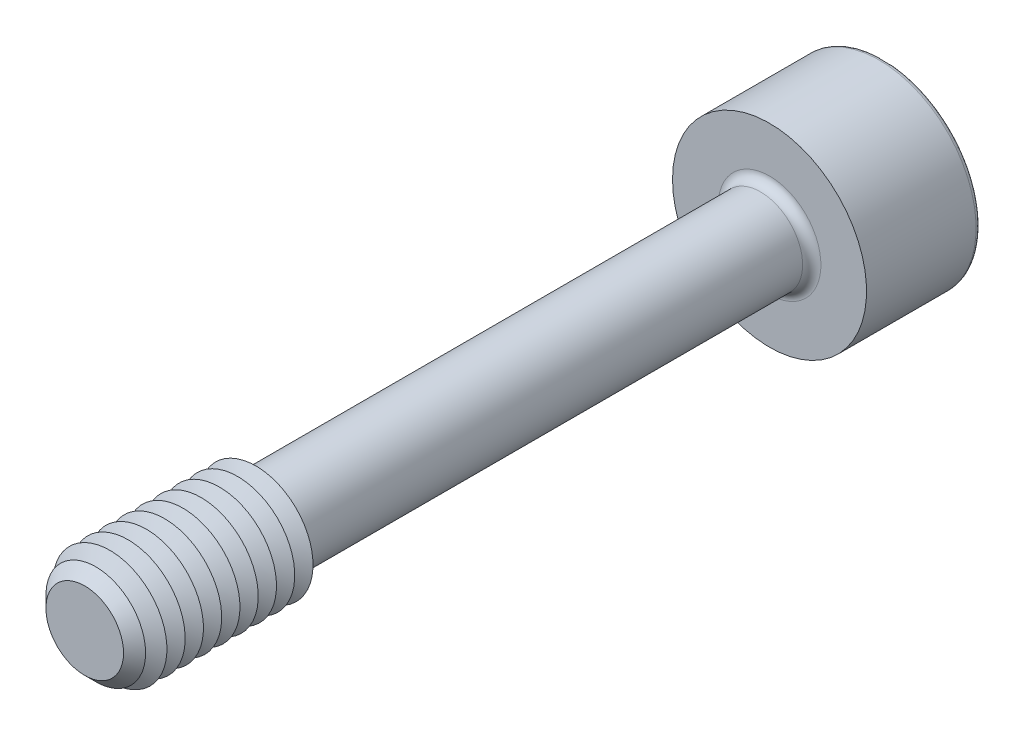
ISO-10303-21;
HEADER;
FILE_DESCRIPTION(('STEP AP214'),'2;1');
FILE_NAME('part.step','',(''),(''),'','','');
FILE_SCHEMA(('AUTOMOTIVE_DESIGN { 1 0 10303 214 1 1 1 1 }'));
ENDSEC;
DATA;
#1=APPLICATION_CONTEXT('core data for automotive mechanical design processes');
#2=APPLICATION_PROTOCOL_DEFINITION('international standard','automotive_design',2000,#1);
#3=PRODUCT_CONTEXT('',#1,'mechanical');
#4=PRODUCT('Part','Part','',(#3));
#5=PRODUCT_RELATED_PRODUCT_CATEGORY('part','',(#4));
#6=PRODUCT_DEFINITION_FORMATION('','',#4);
#7=PRODUCT_DEFINITION_CONTEXT('part definition',#1,'design');
#8=PRODUCT_DEFINITION('design','',#6,#7);
#9=PRODUCT_DEFINITION_SHAPE('','',#8);
#10=(LENGTH_UNIT() NAMED_UNIT(*) SI_UNIT(.MILLI.,.METRE.));
#11=(NAMED_UNIT(*) PLANE_ANGLE_UNIT() SI_UNIT($,.RADIAN.));
#12=(NAMED_UNIT(*) SI_UNIT($,.STERADIAN.) SOLID_ANGLE_UNIT());
#13=UNCERTAINTY_MEASURE_WITH_UNIT(LENGTH_MEASURE(1.E-05),#10,'distance_accuracy_value','');
#14=(GEOMETRIC_REPRESENTATION_CONTEXT(3) GLOBAL_UNCERTAINTY_ASSIGNED_CONTEXT((#13)) GLOBAL_UNIT_ASSIGNED_CONTEXT((#10,
#11,#12)) REPRESENTATION_CONTEXT('',''));
#15=CARTESIAN_POINT('',(0.,0.,0.));
#16=DIRECTION('',(0.,0.,1.));
#17=DIRECTION('',(1.,0.,0.));
#18=AXIS2_PLACEMENT_3D('',#15,#16,#17);
#19=CARTESIAN_POINT('',(-1.15470053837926,-2.,-16.));
#20=DIRECTION('',(0.,0.,1.));
#21=DIRECTION('',(1.,0.,0.));
#22=AXIS2_PLACEMENT_3D('',#19,#20,#21);
#23=PLANE('',#22);
#24=DIRECTION('',(1.,0.,0.));
#25=VECTOR('',#24,1.);
#26=CARTESIAN_POINT('',(-1.15470053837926,-2.,-16.));
#27=LINE('',#26,#25);
#28=CARTESIAN_POINT('',(0.,-2.,-16.));
#29=VERTEX_POINT('',#28);
#30=CARTESIAN_POINT('',(1.15470053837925,-2.,-16.));
#31=VERTEX_POINT('',#30);
#32=EDGE_CURVE('E796',#29,#31,#27,.T.);
#33=ORIENTED_EDGE('',*,*,#32,.F.);
#34=CARTESIAN_POINT('',(0.,0.,-16.));
#35=DIRECTION('',(0.,0.,1.));
#36=DIRECTION('',(0.,-1.,0.));
#37=AXIS2_PLACEMENT_3D('',#34,#35,#36);
#38=CIRCLE('',#37,2.);
#39=CARTESIAN_POINT('',(1.73205080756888,-0.999999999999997,-16.));
#40=VERTEX_POINT('',#39);
#41=EDGE_CURVE('E53',#29,#40,#38,.T.);
#42=ORIENTED_EDGE('',*,*,#41,.T.);
#43=DIRECTION('',(0.5,0.866025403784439,0.));
#44=VECTOR('',#43,1.);
#45=CARTESIAN_POINT('',(1.15470053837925,-2.,-16.));
#46=LINE('',#45,#44);
#47=EDGE_CURVE('E782',#31,#40,#46,.T.);
#48=ORIENTED_EDGE('',*,*,#47,.F.);
#49=EDGE_LOOP('',(#33,#42,#48));
#50=FACE_BOUND('',#49,.T.);
#51=ADVANCED_FACE('F41',(#50),#23,.F.);
#52=CARTESIAN_POINT('',(2.3094010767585,0.,-16.));
#53=VERTEX_POINT('',#52);
#54=EDGE_CURVE('E792',#40,#53,#46,.T.);
#55=ORIENTED_EDGE('',*,*,#54,.F.);
#56=CARTESIAN_POINT('',(1.73205080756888,1.,-16.));
#57=VERTEX_POINT('',#56);
#58=EDGE_CURVE('E11',#40,#57,#38,.T.);
#59=ORIENTED_EDGE('',*,*,#58,.T.);
#60=DIRECTION('',(-0.499999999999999,0.866025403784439,0.));
#61=VECTOR('',#60,1.);
#62=CARTESIAN_POINT('',(2.3094010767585,0.,-16.));
#63=LINE('',#62,#61);
#64=EDGE_CURVE('E781',#53,#57,#63,.T.);
#65=ORIENTED_EDGE('',*,*,#64,.F.);
#66=EDGE_LOOP('',(#55,#59,#65));
#67=FACE_BOUND('',#66,.T.);
#68=ADVANCED_FACE('F133',(#67),#23,.F.);
#69=CARTESIAN_POINT('',(1.15470053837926,2.,-16.));
#70=VERTEX_POINT('',#69);
#71=EDGE_CURVE('E777',#57,#70,#63,.T.);
#72=ORIENTED_EDGE('',*,*,#71,.F.);
#73=CARTESIAN_POINT('',(0.,2.00000000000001,-16.));
#74=VERTEX_POINT('',#73);
#75=EDGE_CURVE('E51',#57,#74,#38,.T.);
#76=ORIENTED_EDGE('',*,*,#75,.T.);
#77=DIRECTION('',(-1.,0.,0.));
#78=VECTOR('',#77,1.);
#79=CARTESIAN_POINT('',(1.15470053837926,2.,-16.));
#80=LINE('',#79,#78);
#81=EDGE_CURVE('E177',#70,#74,#80,.T.);
#82=ORIENTED_EDGE('',*,*,#81,.F.);
#83=EDGE_LOOP('',(#72,#76,#82));
#84=FACE_BOUND('',#83,.T.);
#85=ADVANCED_FACE('F139',(#84),#23,.F.);
#86=CARTESIAN_POINT('',(-1.15470053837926,2.,-16.));
#87=VERTEX_POINT('',#86);
#88=EDGE_CURVE('E786',#74,#87,#80,.T.);
#89=ORIENTED_EDGE('',*,*,#88,.F.);
#90=CARTESIAN_POINT('',(-1.73205080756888,1.00000000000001,-16.));
#91=VERTEX_POINT('',#90);
#92=EDGE_CURVE('E265',#74,#91,#38,.T.);
#93=ORIENTED_EDGE('',*,*,#92,.T.);
#94=DIRECTION('',(-0.5,-0.866025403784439,0.));
#95=VECTOR('',#94,1.);
#96=CARTESIAN_POINT('',(-1.15470053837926,2.,-16.));
#97=LINE('',#96,#95);
#98=EDGE_CURVE('E176',#87,#91,#97,.T.);
#99=ORIENTED_EDGE('',*,*,#98,.F.);
#100=EDGE_LOOP('',(#89,#93,#99));
#101=FACE_BOUND('',#100,.T.);
#102=ADVANCED_FACE('F157',(#101),#23,.F.);
#103=CARTESIAN_POINT('',(-2.30940107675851,0.,-16.));
#104=VERTEX_POINT('',#103);
#105=EDGE_CURVE('E170',#91,#104,#97,.T.);
#106=ORIENTED_EDGE('',*,*,#105,.F.);
#107=CARTESIAN_POINT('',(-1.73205080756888,-0.999999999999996,-16.));
#108=VERTEX_POINT('',#107);
#109=EDGE_CURVE('E172',#91,#108,#38,.T.);
#110=ORIENTED_EDGE('',*,*,#109,.T.);
#111=DIRECTION('',(0.5,-0.866025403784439,0.));
#112=VECTOR('',#111,1.);
#113=CARTESIAN_POINT('',(-2.30940107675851,0.,-16.));
#114=LINE('',#113,#112);
#115=EDGE_CURVE('E174',#104,#108,#114,.T.);
#116=ORIENTED_EDGE('',*,*,#115,.F.);
#117=EDGE_LOOP('',(#106,#110,#116));
#118=FACE_BOUND('',#117,.T.);
#119=ADVANCED_FACE('F146',(#118),#23,.F.);
#120=CARTESIAN_POINT('',(0.,0.,-20.));
#121=DIRECTION('',(0.,0.,-1.));
#122=DIRECTION('',(-1.,0.,0.));
#123=AXIS2_PLACEMENT_3D('',#120,#121,#122);
#124=PLANE('',#123);
#125=CARTESIAN_POINT('',(0.,0.,-20.));
#126=DIRECTION('',(0.,0.,-1.));
#127=DIRECTION('',(-1.,0.,0.));
#128=AXIS2_PLACEMENT_3D('',#125,#126,#127);
#129=CIRCLE('',#128,4.05);
#130=CARTESIAN_POINT('',(-4.05,0.,-20.));
#131=VERTEX_POINT('',#130);
#132=EDGE_CURVE('E250',#131,#131,#129,.T.);
#133=ORIENTED_EDGE('',*,*,#132,.T.);
#134=EDGE_LOOP('',(#133));
#135=FACE_BOUND('',#134,.T.);
#136=DIRECTION('',(-0.5,-0.866025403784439,0.));
#137=VECTOR('',#136,1.);
#138=CARTESIAN_POINT('',(-1.15470053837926,2.,-20.));
#139=LINE('',#138,#137);
#140=CARTESIAN_POINT('',(-1.15470053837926,2.,-20.));
#141=VERTEX_POINT('',#140);
#142=CARTESIAN_POINT('',(-2.30940107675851,0.,-20.));
#143=VERTEX_POINT('',#142);
#144=EDGE_CURVE('E212',#141,#143,#139,.T.);
#145=ORIENTED_EDGE('',*,*,#144,.T.);
#146=DIRECTION('',(0.5,-0.866025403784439,0.));
#147=VECTOR('',#146,1.);
#148=CARTESIAN_POINT('',(-2.30940107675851,0.,-20.));
#149=LINE('',#148,#147);
#150=CARTESIAN_POINT('',(-1.15470053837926,-2.,-20.));
#151=VERTEX_POINT('',#150);
#152=EDGE_CURVE('E67',#143,#151,#149,.T.);
#153=ORIENTED_EDGE('',*,*,#152,.T.);
#154=DIRECTION('',(1.,0.,0.));
#155=VECTOR('',#154,1.);
#156=CARTESIAN_POINT('',(-1.15470053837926,-2.,-20.));
#157=LINE('',#156,#155);
#158=CARTESIAN_POINT('',(1.15470053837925,-2.,-20.));
#159=VERTEX_POINT('',#158);
#160=EDGE_CURVE('E196',#151,#159,#157,.T.);
#161=ORIENTED_EDGE('',*,*,#160,.T.);
#162=DIRECTION('',(0.5,0.866025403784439,0.));
#163=VECTOR('',#162,1.);
#164=CARTESIAN_POINT('',(1.15470053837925,-2.,-20.));
#165=LINE('',#164,#163);
#166=CARTESIAN_POINT('',(2.3094010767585,0.,-20.));
#167=VERTEX_POINT('',#166);
#168=EDGE_CURVE('E200',#159,#167,#165,.T.);
#169=ORIENTED_EDGE('',*,*,#168,.T.);
#170=DIRECTION('',(-0.499999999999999,0.866025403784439,0.));
#171=VECTOR('',#170,1.);
#172=CARTESIAN_POINT('',(2.3094010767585,0.,-20.));
#173=LINE('',#172,#171);
#174=CARTESIAN_POINT('',(1.15470053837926,2.,-20.));
#175=VERTEX_POINT('',#174);
#176=EDGE_CURVE('E204',#167,#175,#173,.T.);
#177=ORIENTED_EDGE('',*,*,#176,.T.);
#178=DIRECTION('',(-1.,0.,0.));
#179=VECTOR('',#178,1.);
#180=CARTESIAN_POINT('',(1.15470053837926,2.,-20.));
#181=LINE('',#180,#179);
#182=EDGE_CURVE('E208',#175,#141,#181,.T.);
#183=ORIENTED_EDGE('',*,*,#182,.T.);
#184=EDGE_LOOP('',(#145,#153,#161,#169,#177,#183));
#185=FACE_BOUND('',#184,.T.);
#186=ADVANCED_FACE('F156',(#135,#185),#124,.T.);
#187=CARTESIAN_POINT('',(0.,0.,15.));
#188=DIRECTION('',(0.,0.,-1.));
#189=DIRECTION('',(-1.,0.,0.));
#190=AXIS2_PLACEMENT_3D('',#187,#188,#189);
#191=CYLINDRICAL_SURFACE('',#190,1.85);
#192=CARTESIAN_POINT('',(0.,0.,-14.6));
#193=DIRECTION('',(0.,0.,-1.));
#194=DIRECTION('',(-1.,0.,0.));
#195=AXIS2_PLACEMENT_3D('',#192,#193,#194);
#196=CIRCLE('',#195,1.85);
#197=CARTESIAN_POINT('',(-1.85,0.,-14.6));
#198=VERTEX_POINT('',#197);
#199=EDGE_CURVE('E246',#198,#198,#196,.F.);
#200=ORIENTED_EDGE('',*,*,#199,.T.);
#201=EDGE_LOOP('',(#200));
#202=FACE_BOUND('',#201,.T.);
#203=CARTESIAN_POINT('',(0.,0.,7.12472232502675));
#204=DIRECTION('',(0.,0.,-1.));
#205=DIRECTION('',(0.,1.,0.));
#206=AXIS2_PLACEMENT_3D('',#203,#204,#205);
#207=CIRCLE('',#206,1.85);
#208=CARTESIAN_POINT('',(0.,1.85,7.12472232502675));
#209=VERTEX_POINT('',#208);
#210=EDGE_CURVE('E235',#209,#209,#207,.T.);
#211=ORIENTED_EDGE('',*,*,#210,.T.);
#212=EDGE_LOOP('',(#211));
#213=FACE_BOUND('',#212,.T.);
#214=ADVANCED_FACE('F163',(#202,#213),#191,.T.);
#215=CARTESIAN_POINT('',(0.,0.,7.12472232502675));
#216=DIRECTION('',(0.,0.,1.));
#217=DIRECTION('',(0.,-1.,0.));
#218=AXIS2_PLACEMENT_3D('',#215,#216,#217);
#219=CONICAL_SURFACE('',#218,1.85,1.0471975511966);
#220=CARTESIAN_POINT('',(0.,0.,7.5));
#221=DIRECTION('',(0.,0.,-1.));
#222=DIRECTION('',(-1.,0.,0.));
#223=AXIS2_PLACEMENT_3D('',#220,#221,#222);
#224=CIRCLE('',#223,2.5);
#225=CARTESIAN_POINT('',(-2.5,0.,7.5));
#226=VERTEX_POINT('',#225);
#227=EDGE_CURVE('E269',#226,#226,#224,.T.);
#228=ORIENTED_EDGE('',*,*,#227,.T.);
#229=EDGE_LOOP('',(#228));
#230=FACE_BOUND('',#229,.T.);
#231=ORIENTED_EDGE('',*,*,#210,.F.);
#232=EDGE_LOOP('',(#231));
#233=FACE_BOUND('',#232,.T.);
#234=ADVANCED_FACE('F538',(#230,#233),#219,.T.);
#235=CARTESIAN_POINT('',(0.,0.,-15.));
#236=DIRECTION('',(0.,0.,-1.));
#237=DIRECTION('',(-1.,0.,0.));
#238=AXIS2_PLACEMENT_3D('',#235,#236,#237);
#239=PLANE('',#238);
#240=CARTESIAN_POINT('',(0.,0.,-15.));
#241=DIRECTION('',(0.,0.,-1.));
#242=DIRECTION('',(-1.,0.,0.));
#243=AXIS2_PLACEMENT_3D('',#240,#241,#242);
#244=CIRCLE('',#243,2.25);
#245=CARTESIAN_POINT('',(-2.25,0.,-15.));
#246=VERTEX_POINT('',#245);
#247=EDGE_CURVE('E243',#246,#246,#244,.T.);
#248=ORIENTED_EDGE('',*,*,#247,.T.);
#249=EDGE_LOOP('',(#248));
#250=FACE_BOUND('',#249,.T.);
#251=CARTESIAN_POINT('',(0.,0.,-15.));
#252=DIRECTION('',(0.,0.,-1.));
#253=DIRECTION('',(-1.,0.,0.));
#254=AXIS2_PLACEMENT_3D('',#251,#252,#253);
#255=CIRCLE('',#254,4.25);
#256=CARTESIAN_POINT('',(-4.25,0.,-15.));
#257=VERTEX_POINT('',#256);
#258=EDGE_CURVE('E231',#257,#257,#255,.T.);
#259=ORIENTED_EDGE('',*,*,#258,.F.);
#260=EDGE_LOOP('',(#259));
#261=FACE_BOUND('',#260,.T.);
#262=ADVANCED_FACE('F531',(#250,#261),#239,.F.);
#263=CARTESIAN_POINT('',(0.,0.,-20.));
#264=DIRECTION('',(0.,0.,1.));
#265=DIRECTION('',(1.,0.,0.));
#266=AXIS2_PLACEMENT_3D('',#263,#264,#265);
#267=CYLINDRICAL_SURFACE('',#266,4.25);
#268=CARTESIAN_POINT('',(0.,0.,-19.8));
#269=DIRECTION('',(0.,0.,-1.));
#270=DIRECTION('',(-1.,0.,0.));
#271=AXIS2_PLACEMENT_3D('',#268,#269,#270);
#272=CIRCLE('',#271,4.25);
#273=CARTESIAN_POINT('',(-4.25,0.,-19.8));
#274=VERTEX_POINT('',#273);
#275=EDGE_CURVE('E253',#274,#274,#272,.F.);
#276=ORIENTED_EDGE('',*,*,#275,.T.);
#277=EDGE_LOOP('',(#276));
#278=FACE_BOUND('',#277,.T.);
#279=ORIENTED_EDGE('',*,*,#258,.T.);
#280=EDGE_LOOP('',(#279));
#281=FACE_BOUND('',#280,.T.);
#282=ADVANCED_FACE('F537',(#278,#281),#267,.T.);
#283=CARTESIAN_POINT('',(-2.30940107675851,0.,-16.));
#284=DIRECTION('',(0.866025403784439,0.5,0.));
#285=DIRECTION('',(-0.5,0.866025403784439,0.));
#286=AXIS2_PLACEMENT_3D('',#283,#284,#285);
#287=PLANE('',#286);
#288=ORIENTED_EDGE('',*,*,#152,.F.);
#289=DIRECTION('',(0.,0.,-1.));
#290=VECTOR('',#289,1.);
#291=CARTESIAN_POINT('',(-2.30940107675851,0.,-16.));
#292=LINE('',#291,#290);
#293=EDGE_CURVE('E186',#104,#143,#292,.T.);
#294=ORIENTED_EDGE('',*,*,#293,.F.);
#295=ORIENTED_EDGE('',*,*,#115,.T.);
#296=CARTESIAN_POINT('',(-1.15470053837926,-2.,-16.));
#297=VERTEX_POINT('',#296);
#298=EDGE_CURVE('E215',#108,#297,#114,.T.);
#299=ORIENTED_EDGE('',*,*,#298,.T.);
#300=DIRECTION('',(0.,0.,-1.));
#301=VECTOR('',#300,1.);
#302=CARTESIAN_POINT('',(-1.15470053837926,-2.,-16.));
#303=LINE('',#302,#301);
#304=EDGE_CURVE('E228',#297,#151,#303,.T.);
#305=ORIENTED_EDGE('',*,*,#304,.T.);
#306=EDGE_LOOP('',(#288,#294,#295,#299,#305));
#307=FACE_BOUND('',#306,.T.);
#308=ADVANCED_FACE('F549',(#307),#287,.T.);
#309=CARTESIAN_POINT('',(-1.15470053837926,-2.,-16.));
#310=DIRECTION('',(0.,1.,0.));
#311=DIRECTION('',(-1.,0.,0.));
#312=AXIS2_PLACEMENT_3D('',#309,#310,#311);
#313=PLANE('',#312);
#314=ORIENTED_EDGE('',*,*,#160,.F.);
#315=ORIENTED_EDGE('',*,*,#304,.F.);
#316=EDGE_CURVE('E793',#297,#29,#27,.T.);
#317=ORIENTED_EDGE('',*,*,#316,.T.);
#318=ORIENTED_EDGE('',*,*,#32,.T.);
#319=DIRECTION('',(0.,0.,-1.));
#320=VECTOR('',#319,1.);
#321=CARTESIAN_POINT('',(1.15470053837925,-2.,-16.));
#322=LINE('',#321,#320);
#323=EDGE_CURVE('E225',#31,#159,#322,.T.);
#324=ORIENTED_EDGE('',*,*,#323,.T.);
#325=EDGE_LOOP('',(#314,#315,#317,#318,#324));
#326=FACE_BOUND('',#325,.T.);
#327=ADVANCED_FACE('F565',(#326),#313,.T.);
#328=CARTESIAN_POINT('',(1.15470053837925,-2.,-16.));
#329=DIRECTION('',(-0.866025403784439,0.5,0.));
#330=DIRECTION('',(-0.5,-0.866025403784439,0.));
#331=AXIS2_PLACEMENT_3D('',#328,#329,#330);
#332=PLANE('',#331);
#333=ORIENTED_EDGE('',*,*,#168,.F.);
#334=ORIENTED_EDGE('',*,*,#323,.F.);
#335=ORIENTED_EDGE('',*,*,#47,.T.);
#336=ORIENTED_EDGE('',*,*,#54,.T.);
#337=DIRECTION('',(0.,0.,-1.));
#338=VECTOR('',#337,1.);
#339=CARTESIAN_POINT('',(2.3094010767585,0.,-16.));
#340=LINE('',#339,#338);
#341=EDGE_CURVE('E222',#53,#167,#340,.T.);
#342=ORIENTED_EDGE('',*,*,#341,.T.);
#343=EDGE_LOOP('',(#333,#334,#335,#336,#342));
#344=FACE_BOUND('',#343,.T.);
#345=ADVANCED_FACE('F575',(#344),#332,.T.);
#346=CARTESIAN_POINT('',(2.3094010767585,0.,-16.));
#347=DIRECTION('',(-0.866025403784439,-0.499999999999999,0.));
#348=DIRECTION('',(0.499999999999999,-0.866025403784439,0.));
#349=AXIS2_PLACEMENT_3D('',#346,#347,#348);
#350=PLANE('',#349);
#351=ORIENTED_EDGE('',*,*,#176,.F.);
#352=ORIENTED_EDGE('',*,*,#341,.F.);
#353=ORIENTED_EDGE('',*,*,#64,.T.);
#354=ORIENTED_EDGE('',*,*,#71,.T.);
#355=DIRECTION('',(0.,0.,-1.));
#356=VECTOR('',#355,1.);
#357=CARTESIAN_POINT('',(1.15470053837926,2.,-16.));
#358=LINE('',#357,#356);
#359=EDGE_CURVE('E219',#70,#175,#358,.T.);
#360=ORIENTED_EDGE('',*,*,#359,.T.);
#361=EDGE_LOOP('',(#351,#352,#353,#354,#360));
#362=FACE_BOUND('',#361,.T.);
#363=ADVANCED_FACE('F585',(#362),#350,.T.);
#364=CARTESIAN_POINT('',(1.15470053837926,2.,-16.));
#365=DIRECTION('',(0.,-1.,0.));
#366=DIRECTION('',(0.,0.,-1.));
#367=AXIS2_PLACEMENT_3D('',#364,#365,#366);
#368=PLANE('',#367);
#369=ORIENTED_EDGE('',*,*,#182,.F.);
#370=ORIENTED_EDGE('',*,*,#359,.F.);
#371=ORIENTED_EDGE('',*,*,#81,.T.);
#372=ORIENTED_EDGE('',*,*,#88,.T.);
#373=DIRECTION('',(0.,0.,-1.));
#374=VECTOR('',#373,1.);
#375=CARTESIAN_POINT('',(-1.15470053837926,2.,-16.));
#376=LINE('',#375,#374);
#377=EDGE_CURVE('E182',#87,#141,#376,.T.);
#378=ORIENTED_EDGE('',*,*,#377,.T.);
#379=EDGE_LOOP('',(#369,#370,#371,#372,#378));
#380=FACE_BOUND('',#379,.T.);
#381=ADVANCED_FACE('F152',(#380),#368,.T.);
#382=CARTESIAN_POINT('',(-1.15470053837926,2.,-16.));
#383=DIRECTION('',(0.866025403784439,-0.5,0.));
#384=DIRECTION('',(0.5,0.866025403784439,0.));
#385=AXIS2_PLACEMENT_3D('',#382,#383,#384);
#386=PLANE('',#385);
#387=ORIENTED_EDGE('',*,*,#144,.F.);
#388=ORIENTED_EDGE('',*,*,#377,.F.);
#389=ORIENTED_EDGE('',*,*,#98,.T.);
#390=ORIENTED_EDGE('',*,*,#105,.T.);
#391=ORIENTED_EDGE('',*,*,#293,.T.);
#392=EDGE_LOOP('',(#387,#388,#389,#390,#391));
#393=FACE_BOUND('',#392,.T.);
#394=ADVANCED_FACE('F144',(#393),#386,.T.);
#395=ORIENTED_EDGE('',*,*,#298,.F.);
#396=EDGE_CURVE('E256',#108,#29,#38,.T.);
#397=ORIENTED_EDGE('',*,*,#396,.T.);
#398=ORIENTED_EDGE('',*,*,#316,.F.);
#399=EDGE_LOOP('',(#395,#397,#398));
#400=FACE_BOUND('',#399,.T.);
#401=ADVANCED_FACE('F135',(#400),#23,.F.);
#402=CARTESIAN_POINT('',(0.,0.,-14.6));
#403=DIRECTION('',(0.,0.,-1.));
#404=DIRECTION('',(-1.,0.,0.));
#405=AXIS2_PLACEMENT_3D('',#402,#403,#404);
#406=TOROIDAL_SURFACE('',#405,2.25,0.4);
#407=ORIENTED_EDGE('',*,*,#199,.F.);
#408=EDGE_LOOP('',(#407));
#409=FACE_BOUND('',#408,.T.);
#410=ORIENTED_EDGE('',*,*,#247,.F.);
#411=EDGE_LOOP('',(#410));
#412=FACE_BOUND('',#411,.T.);
#413=ADVANCED_FACE('F129',(#409,#412),#406,.F.);
#414=CARTESIAN_POINT('',(0.,0.,-19.8));
#415=DIRECTION('',(0.,0.,-1.));
#416=DIRECTION('',(-1.,0.,0.));
#417=AXIS2_PLACEMENT_3D('',#414,#415,#416);
#418=TOROIDAL_SURFACE('',#417,4.05,0.2);
#419=ORIENTED_EDGE('',*,*,#275,.F.);
#420=EDGE_LOOP('',(#419));
#421=FACE_BOUND('',#420,.T.);
#422=ORIENTED_EDGE('',*,*,#132,.F.);
#423=EDGE_LOOP('',(#422));
#424=FACE_BOUND('',#423,.T.);
#425=ADVANCED_FACE('F43',(#421,#424),#418,.T.);
#426=CARTESIAN_POINT('',(0.,0.,-14.8452994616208));
#427=DIRECTION('',(0.,0.,-1.));
#428=DIRECTION('',(0.,1.,0.));
#429=AXIS2_PLACEMENT_3D('',#426,#427,#428);
#430=CONICAL_SURFACE('',#429,0.,1.04719755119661);
#431=ORIENTED_EDGE('',*,*,#41,.F.);
#432=ORIENTED_EDGE('',*,*,#396,.F.);
#433=ORIENTED_EDGE('',*,*,#109,.F.);
#434=ORIENTED_EDGE('',*,*,#92,.F.);
#435=ORIENTED_EDGE('',*,*,#75,.F.);
#436=ORIENTED_EDGE('',*,*,#58,.F.);
#437=EDGE_LOOP('',(#431,#432,#433,#434,#435,#436));
#438=FACE_BOUND('',#437,.T.);
#439=CARTESIAN_POINT('',(0.,0.,-14.8452994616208));
#440=VERTEX_POINT('',#439);
#441=VERTEX_LOOP('',#440);
#442=FACE_BOUND('',#441,.T.);
#443=ADVANCED_FACE('F118',(#438,#442),#430,.F.);
#444=CARTESIAN_POINT('',(0.,0.,7.9));
#445=DIRECTION('',(0.,0.,-1.));
#446=DIRECTION('',(-1.,0.,0.));
#447=AXIS2_PLACEMENT_3D('',#444,#445,#446);
#448=CONICAL_SURFACE('',#447,1.80717967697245,1.0471975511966);
#449=ORIENTED_EDGE('',*,*,#227,.F.);
#450=EDGE_LOOP('',(#449));
#451=FACE_BOUND('',#450,.T.);
#452=CARTESIAN_POINT('',(0.,0.,7.9));
#453=DIRECTION('',(0.,0.,-1.));
#454=DIRECTION('',(-1.,0.,0.));
#455=AXIS2_PLACEMENT_3D('',#452,#453,#454);
#456=CIRCLE('',#455,1.80717967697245);
#457=CARTESIAN_POINT('',(-1.80717967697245,0.,7.9));
#458=VERTEX_POINT('',#457);
#459=EDGE_CURVE('E275',#458,#458,#456,.T.);
#460=ORIENTED_EDGE('',*,*,#459,.T.);
#461=EDGE_LOOP('',(#460));
#462=FACE_BOUND('',#461,.T.);
#463=ADVANCED_FACE('F120',(#451,#462),#448,.T.);
#464=CARTESIAN_POINT('',(0.,0.,8.3));
#465=DIRECTION('',(0.,0.,1.));
#466=DIRECTION('',(1.,0.,0.));
#467=AXIS2_PLACEMENT_3D('',#464,#465,#466);
#468=CONICAL_SURFACE('',#467,2.5,1.0471975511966);
#469=ORIENTED_EDGE('',*,*,#459,.F.);
#470=EDGE_LOOP('',(#469));
#471=FACE_BOUND('',#470,.T.);
#472=CARTESIAN_POINT('',(0.,0.,8.3));
#473=DIRECTION('',(0.,0.,-1.));
#474=DIRECTION('',(-1.,0.,0.));
#475=AXIS2_PLACEMENT_3D('',#472,#473,#474);
#476=CIRCLE('',#475,2.5);
#477=CARTESIAN_POINT('',(-2.5,0.,8.3));
#478=VERTEX_POINT('',#477);
#479=EDGE_CURVE('E281',#478,#478,#476,.T.);
#480=ORIENTED_EDGE('',*,*,#479,.T.);
#481=EDGE_LOOP('',(#480));
#482=FACE_BOUND('',#481,.T.);
#483=ADVANCED_FACE('F126',(#471,#482),#468,.T.);
#484=CARTESIAN_POINT('',(0.,0.,8.7));
#485=DIRECTION('',(0.,0.,-1.));
#486=DIRECTION('',(-1.,0.,0.));
#487=AXIS2_PLACEMENT_3D('',#484,#485,#486);
#488=CONICAL_SURFACE('',#487,1.80717967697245,1.0471975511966);
#489=ORIENTED_EDGE('',*,*,#479,.F.);
#490=EDGE_LOOP('',(#489));
#491=FACE_BOUND('',#490,.T.);
#492=CARTESIAN_POINT('',(0.,0.,8.7));
#493=DIRECTION('',(0.,0.,-1.));
#494=DIRECTION('',(-1.,0.,0.));
#495=AXIS2_PLACEMENT_3D('',#492,#493,#494);
#496=CIRCLE('',#495,1.80717967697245);
#497=CARTESIAN_POINT('',(-1.80717967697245,0.,8.7));
#498=VERTEX_POINT('',#497);
#499=EDGE_CURVE('E286',#498,#498,#496,.T.);
#500=ORIENTED_EDGE('',*,*,#499,.T.);
#501=EDGE_LOOP('',(#500));
#502=FACE_BOUND('',#501,.T.);
#503=ADVANCED_FACE('F415',(#491,#502),#488,.T.);
#504=CARTESIAN_POINT('',(0.,0.,9.1));
#505=DIRECTION('',(0.,0.,1.));
#506=DIRECTION('',(1.,0.,0.));
#507=AXIS2_PLACEMENT_3D('',#504,#505,#506);
#508=CONICAL_SURFACE('',#507,2.5,1.0471975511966);
#509=ORIENTED_EDGE('',*,*,#499,.F.);
#510=EDGE_LOOP('',(#509));
#511=FACE_BOUND('',#510,.T.);
#512=CARTESIAN_POINT('',(0.,0.,9.1));
#513=DIRECTION('',(0.,0.,-1.));
#514=DIRECTION('',(-1.,0.,0.));
#515=AXIS2_PLACEMENT_3D('',#512,#513,#514);
#516=CIRCLE('',#515,2.5);
#517=CARTESIAN_POINT('',(-2.5,0.,9.1));
#518=VERTEX_POINT('',#517);
#519=EDGE_CURVE('E290',#518,#518,#516,.T.);
#520=ORIENTED_EDGE('',*,*,#519,.T.);
#521=EDGE_LOOP('',(#520));
#522=FACE_BOUND('',#521,.T.);
#523=ADVANCED_FACE('F411',(#511,#522),#508,.T.);
#524=CARTESIAN_POINT('',(0.,0.,9.5));
#525=DIRECTION('',(0.,0.,-1.));
#526=DIRECTION('',(-1.,0.,0.));
#527=AXIS2_PLACEMENT_3D('',#524,#525,#526);
#528=CONICAL_SURFACE('',#527,1.80717967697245,1.0471975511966);
#529=ORIENTED_EDGE('',*,*,#519,.F.);
#530=EDGE_LOOP('',(#529));
#531=FACE_BOUND('',#530,.T.);
#532=CARTESIAN_POINT('',(0.,0.,9.5));
#533=DIRECTION('',(0.,0.,-1.));
#534=DIRECTION('',(-1.,0.,0.));
#535=AXIS2_PLACEMENT_3D('',#532,#533,#534);
#536=CIRCLE('',#535,1.80717967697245);
#537=CARTESIAN_POINT('',(-1.80717967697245,0.,9.5));
#538=VERTEX_POINT('',#537);
#539=EDGE_CURVE('E294',#538,#538,#536,.T.);
#540=ORIENTED_EDGE('',*,*,#539,.T.);
#541=EDGE_LOOP('',(#540));
#542=FACE_BOUND('',#541,.T.);
#543=ADVANCED_FACE('F407',(#531,#542),#528,.T.);
#544=CARTESIAN_POINT('',(0.,0.,9.9));
#545=DIRECTION('',(0.,0.,1.));
#546=DIRECTION('',(1.,0.,0.));
#547=AXIS2_PLACEMENT_3D('',#544,#545,#546);
#548=CONICAL_SURFACE('',#547,2.5,1.0471975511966);
#549=ORIENTED_EDGE('',*,*,#539,.F.);
#550=EDGE_LOOP('',(#549));
#551=FACE_BOUND('',#550,.T.);
#552=CARTESIAN_POINT('',(0.,0.,9.9));
#553=DIRECTION('',(0.,0.,-1.));
#554=DIRECTION('',(-1.,0.,0.));
#555=AXIS2_PLACEMENT_3D('',#552,#553,#554);
#556=CIRCLE('',#555,2.5);
#557=CARTESIAN_POINT('',(-2.5,0.,9.9));
#558=VERTEX_POINT('',#557);
#559=EDGE_CURVE('E298',#558,#558,#556,.T.);
#560=ORIENTED_EDGE('',*,*,#559,.T.);
#561=EDGE_LOOP('',(#560));
#562=FACE_BOUND('',#561,.T.);
#563=ADVANCED_FACE('F403',(#551,#562),#548,.T.);
#564=CARTESIAN_POINT('',(0.,0.,10.3));
#565=DIRECTION('',(0.,0.,-1.));
#566=DIRECTION('',(-1.,0.,0.));
#567=AXIS2_PLACEMENT_3D('',#564,#565,#566);
#568=CONICAL_SURFACE('',#567,1.80717967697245,1.0471975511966);
#569=ORIENTED_EDGE('',*,*,#559,.F.);
#570=EDGE_LOOP('',(#569));
#571=FACE_BOUND('',#570,.T.);
#572=CARTESIAN_POINT('',(0.,0.,10.3));
#573=DIRECTION('',(0.,0.,-1.));
#574=DIRECTION('',(-1.,0.,0.));
#575=AXIS2_PLACEMENT_3D('',#572,#573,#574);
#576=CIRCLE('',#575,1.80717967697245);
#577=CARTESIAN_POINT('',(-1.80717967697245,0.,10.3));
#578=VERTEX_POINT('',#577);
#579=EDGE_CURVE('E302',#578,#578,#576,.T.);
#580=ORIENTED_EDGE('',*,*,#579,.T.);
#581=EDGE_LOOP('',(#580));
#582=FACE_BOUND('',#581,.T.);
#583=ADVANCED_FACE('F399',(#571,#582),#568,.T.);
#584=CARTESIAN_POINT('',(0.,0.,10.7));
#585=DIRECTION('',(0.,0.,1.));
#586=DIRECTION('',(1.,0.,0.));
#587=AXIS2_PLACEMENT_3D('',#584,#585,#586);
#588=CONICAL_SURFACE('',#587,2.5,1.0471975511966);
#589=ORIENTED_EDGE('',*,*,#579,.F.);
#590=EDGE_LOOP('',(#589));
#591=FACE_BOUND('',#590,.T.);
#592=CARTESIAN_POINT('',(0.,0.,10.7));
#593=DIRECTION('',(0.,0.,-1.));
#594=DIRECTION('',(-1.,0.,0.));
#595=AXIS2_PLACEMENT_3D('',#592,#593,#594);
#596=CIRCLE('',#595,2.5);
#597=CARTESIAN_POINT('',(-2.5,0.,10.7));
#598=VERTEX_POINT('',#597);
#599=EDGE_CURVE('E306',#598,#598,#596,.T.);
#600=ORIENTED_EDGE('',*,*,#599,.T.);
#601=EDGE_LOOP('',(#600));
#602=FACE_BOUND('',#601,.T.);
#603=ADVANCED_FACE('F395',(#591,#602),#588,.T.);
#604=CARTESIAN_POINT('',(0.,0.,11.1));
#605=DIRECTION('',(0.,0.,-1.));
#606=DIRECTION('',(-1.,0.,0.));
#607=AXIS2_PLACEMENT_3D('',#604,#605,#606);
#608=CONICAL_SURFACE('',#607,1.80717967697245,1.0471975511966);
#609=ORIENTED_EDGE('',*,*,#599,.F.);
#610=EDGE_LOOP('',(#609));
#611=FACE_BOUND('',#610,.T.);
#612=CARTESIAN_POINT('',(0.,0.,11.1));
#613=DIRECTION('',(0.,0.,-1.));
#614=DIRECTION('',(-1.,0.,0.));
#615=AXIS2_PLACEMENT_3D('',#612,#613,#614);
#616=CIRCLE('',#615,1.80717967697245);
#617=CARTESIAN_POINT('',(-1.80717967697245,0.,11.1));
#618=VERTEX_POINT('',#617);
#619=EDGE_CURVE('E310',#618,#618,#616,.T.);
#620=ORIENTED_EDGE('',*,*,#619,.T.);
#621=EDGE_LOOP('',(#620));
#622=FACE_BOUND('',#621,.T.);
#623=ADVANCED_FACE('F391',(#611,#622),#608,.T.);
#624=CARTESIAN_POINT('',(0.,0.,11.5));
#625=DIRECTION('',(0.,0.,1.));
#626=DIRECTION('',(1.,0.,0.));
#627=AXIS2_PLACEMENT_3D('',#624,#625,#626);
#628=CONICAL_SURFACE('',#627,2.5,1.0471975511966);
#629=ORIENTED_EDGE('',*,*,#619,.F.);
#630=EDGE_LOOP('',(#629));
#631=FACE_BOUND('',#630,.T.);
#632=CARTESIAN_POINT('',(0.,0.,11.5));
#633=DIRECTION('',(0.,0.,-1.));
#634=DIRECTION('',(-1.,0.,0.));
#635=AXIS2_PLACEMENT_3D('',#632,#633,#634);
#636=CIRCLE('',#635,2.5);
#637=CARTESIAN_POINT('',(-2.5,0.,11.5));
#638=VERTEX_POINT('',#637);
#639=EDGE_CURVE('E314',#638,#638,#636,.T.);
#640=ORIENTED_EDGE('',*,*,#639,.T.);
#641=EDGE_LOOP('',(#640));
#642=FACE_BOUND('',#641,.T.);
#643=ADVANCED_FACE('F387',(#631,#642),#628,.T.);
#644=CARTESIAN_POINT('',(0.,0.,11.9));
#645=DIRECTION('',(0.,0.,-1.));
#646=DIRECTION('',(-1.,0.,0.));
#647=AXIS2_PLACEMENT_3D('',#644,#645,#646);
#648=CONICAL_SURFACE('',#647,1.80717967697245,1.0471975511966);
#649=ORIENTED_EDGE('',*,*,#639,.F.);
#650=EDGE_LOOP('',(#649));
#651=FACE_BOUND('',#650,.T.);
#652=CARTESIAN_POINT('',(0.,0.,11.9));
#653=DIRECTION('',(0.,0.,-1.));
#654=DIRECTION('',(-1.,0.,0.));
#655=AXIS2_PLACEMENT_3D('',#652,#653,#654);
#656=CIRCLE('',#655,1.80717967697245);
#657=CARTESIAN_POINT('',(-1.80717967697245,0.,11.9));
#658=VERTEX_POINT('',#657);
#659=EDGE_CURVE('E318',#658,#658,#656,.T.);
#660=ORIENTED_EDGE('',*,*,#659,.T.);
#661=EDGE_LOOP('',(#660));
#662=FACE_BOUND('',#661,.T.);
#663=ADVANCED_FACE('F383',(#651,#662),#648,.T.);
#664=CARTESIAN_POINT('',(0.,0.,12.3));
#665=DIRECTION('',(0.,0.,1.));
#666=DIRECTION('',(1.,0.,0.));
#667=AXIS2_PLACEMENT_3D('',#664,#665,#666);
#668=CONICAL_SURFACE('',#667,2.5,1.0471975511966);
#669=ORIENTED_EDGE('',*,*,#659,.F.);
#670=EDGE_LOOP('',(#669));
#671=FACE_BOUND('',#670,.T.);
#672=CARTESIAN_POINT('',(0.,0.,12.3));
#673=DIRECTION('',(0.,0.,-1.));
#674=DIRECTION('',(-1.,0.,0.));
#675=AXIS2_PLACEMENT_3D('',#672,#673,#674);
#676=CIRCLE('',#675,2.5);
#677=CARTESIAN_POINT('',(-2.5,0.,12.3));
#678=VERTEX_POINT('',#677);
#679=EDGE_CURVE('E322',#678,#678,#676,.T.);
#680=ORIENTED_EDGE('',*,*,#679,.T.);
#681=EDGE_LOOP('',(#680));
#682=FACE_BOUND('',#681,.T.);
#683=ADVANCED_FACE('F379',(#671,#682),#668,.T.);
#684=CARTESIAN_POINT('',(0.,0.,12.7));
#685=DIRECTION('',(0.,0.,-1.));
#686=DIRECTION('',(-1.,0.,0.));
#687=AXIS2_PLACEMENT_3D('',#684,#685,#686);
#688=CONICAL_SURFACE('',#687,1.80717967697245,1.0471975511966);
#689=ORIENTED_EDGE('',*,*,#679,.F.);
#690=EDGE_LOOP('',(#689));
#691=FACE_BOUND('',#690,.T.);
#692=CARTESIAN_POINT('',(0.,0.,12.7));
#693=DIRECTION('',(0.,0.,-1.));
#694=DIRECTION('',(-1.,0.,0.));
#695=AXIS2_PLACEMENT_3D('',#692,#693,#694);
#696=CIRCLE('',#695,1.80717967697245);
#697=CARTESIAN_POINT('',(-1.80717967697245,0.,12.7));
#698=VERTEX_POINT('',#697);
#699=EDGE_CURVE('E326',#698,#698,#696,.T.);
#700=ORIENTED_EDGE('',*,*,#699,.T.);
#701=EDGE_LOOP('',(#700));
#702=FACE_BOUND('',#701,.T.);
#703=ADVANCED_FACE('F375',(#691,#702),#688,.T.);
#704=CARTESIAN_POINT('',(0.,0.,13.1));
#705=DIRECTION('',(0.,0.,1.));
#706=DIRECTION('',(1.,0.,0.));
#707=AXIS2_PLACEMENT_3D('',#704,#705,#706);
#708=CONICAL_SURFACE('',#707,2.5,1.0471975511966);
#709=ORIENTED_EDGE('',*,*,#699,.F.);
#710=EDGE_LOOP('',(#709));
#711=FACE_BOUND('',#710,.T.);
#712=CARTESIAN_POINT('',(0.,0.,13.1));
#713=DIRECTION('',(0.,0.,-1.));
#714=DIRECTION('',(-1.,0.,0.));
#715=AXIS2_PLACEMENT_3D('',#712,#713,#714);
#716=CIRCLE('',#715,2.5);
#717=CARTESIAN_POINT('',(-2.5,0.,13.1));
#718=VERTEX_POINT('',#717);
#719=EDGE_CURVE('E330',#718,#718,#716,.T.);
#720=ORIENTED_EDGE('',*,*,#719,.T.);
#721=EDGE_LOOP('',(#720));
#722=FACE_BOUND('',#721,.T.);
#723=ADVANCED_FACE('F371',(#711,#722),#708,.T.);
#724=CARTESIAN_POINT('',(0.,0.,13.5));
#725=DIRECTION('',(0.,0.,-1.));
#726=DIRECTION('',(-1.,0.,0.));
#727=AXIS2_PLACEMENT_3D('',#724,#725,#726);
#728=CONICAL_SURFACE('',#727,1.80717967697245,1.0471975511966);
#729=ORIENTED_EDGE('',*,*,#719,.F.);
#730=EDGE_LOOP('',(#729));
#731=FACE_BOUND('',#730,.T.);
#732=CARTESIAN_POINT('',(0.,0.,13.5));
#733=DIRECTION('',(0.,0.,-1.));
#734=DIRECTION('',(-1.,0.,0.));
#735=AXIS2_PLACEMENT_3D('',#732,#733,#734);
#736=CIRCLE('',#735,1.80717967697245);
#737=CARTESIAN_POINT('',(-1.80717967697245,0.,13.5));
#738=VERTEX_POINT('',#737);
#739=EDGE_CURVE('E334',#738,#738,#736,.T.);
#740=ORIENTED_EDGE('',*,*,#739,.T.);
#741=EDGE_LOOP('',(#740));
#742=FACE_BOUND('',#741,.T.);
#743=ADVANCED_FACE('F367',(#731,#742),#728,.T.);
#744=CARTESIAN_POINT('',(0.,0.,13.9));
#745=DIRECTION('',(0.,0.,1.));
#746=DIRECTION('',(1.,0.,0.));
#747=AXIS2_PLACEMENT_3D('',#744,#745,#746);
#748=CONICAL_SURFACE('',#747,2.5,1.0471975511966);
#749=ORIENTED_EDGE('',*,*,#739,.F.);
#750=EDGE_LOOP('',(#749));
#751=FACE_BOUND('',#750,.T.);
#752=CARTESIAN_POINT('',(0.,0.,13.9));
#753=DIRECTION('',(0.,0.,-1.));
#754=DIRECTION('',(-1.,0.,0.));
#755=AXIS2_PLACEMENT_3D('',#752,#753,#754);
#756=CIRCLE('',#755,2.5);
#757=CARTESIAN_POINT('',(-2.5,0.,13.9));
#758=VERTEX_POINT('',#757);
#759=EDGE_CURVE('E338',#758,#758,#756,.T.);
#760=ORIENTED_EDGE('',*,*,#759,.T.);
#761=EDGE_LOOP('',(#760));
#762=FACE_BOUND('',#761,.T.);
#763=ADVANCED_FACE('F360',(#751,#762),#748,.T.);
#764=CARTESIAN_POINT('',(0.,0.,14.3));
#765=DIRECTION('',(0.,0.,-1.));
#766=DIRECTION('',(-1.,0.,0.));
#767=AXIS2_PLACEMENT_3D('',#764,#765,#766);
#768=CONICAL_SURFACE('',#767,1.80717967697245,1.0471975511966);
#769=ORIENTED_EDGE('',*,*,#759,.F.);
#770=EDGE_LOOP('',(#769));
#771=FACE_BOUND('',#770,.T.);
#772=CARTESIAN_POINT('',(0.,0.,14.3));
#773=DIRECTION('',(0.,0.,-1.));
#774=DIRECTION('',(-1.,0.,0.));
#775=AXIS2_PLACEMENT_3D('',#772,#773,#774);
#776=CIRCLE('',#775,1.80717967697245);
#777=CARTESIAN_POINT('',(-1.80717967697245,0.,14.3));
#778=VERTEX_POINT('',#777);
#779=EDGE_CURVE('E341',#778,#778,#776,.T.);
#780=ORIENTED_EDGE('',*,*,#779,.T.);
#781=EDGE_LOOP('',(#780));
#782=FACE_BOUND('',#781,.T.);
#783=ADVANCED_FACE('F346',(#771,#782),#768,.T.);
#784=CARTESIAN_POINT('',(0.,0.,14.7));
#785=DIRECTION('',(0.,0.,1.));
#786=DIRECTION('',(1.,0.,0.));
#787=AXIS2_PLACEMENT_3D('',#784,#785,#786);
#788=CONICAL_SURFACE('',#787,2.5,1.0471975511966);
#789=CARTESIAN_POINT('',(0.,0.,14.5169872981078));
#790=DIRECTION('',(0.,0.,1.));
#791=DIRECTION('',(1.,0.,0.));
#792=AXIS2_PLACEMENT_3D('',#789,#790,#791);
#793=CIRCLE('',#792,2.18301270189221);
#794=CARTESIAN_POINT('',(2.18301270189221,0.,14.5169872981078));
#795=VERTEX_POINT('',#794);
#796=EDGE_CURVE('E45',#795,#795,#793,.F.);
#797=ORIENTED_EDGE('',*,*,#796,.T.);
#798=EDGE_LOOP('',(#797));
#799=FACE_BOUND('',#798,.T.);
#800=ORIENTED_EDGE('',*,*,#779,.F.);
#801=EDGE_LOOP('',(#800));
#802=FACE_BOUND('',#801,.T.);
#803=ADVANCED_FACE('F348',(#799,#802),#788,.T.);
#804=CARTESIAN_POINT('',(0.,0.,15.));
#805=DIRECTION('',(0.,0.,1.));
#806=DIRECTION('',(1.,0.,0.));
#807=AXIS2_PLACEMENT_3D('',#804,#805,#806);
#808=PLANE('',#807);
#809=CARTESIAN_POINT('',(0.,0.,15.));
#810=DIRECTION('',(0.,0.,1.));
#811=DIRECTION('',(1.,0.,0.));
#812=AXIS2_PLACEMENT_3D('',#809,#810,#811);
#813=CIRCLE('',#812,1.69999999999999);
#814=CARTESIAN_POINT('',(1.69999999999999,0.,15.));
#815=VERTEX_POINT('',#814);
#816=EDGE_CURVE('E239',#815,#815,#813,.T.);
#817=ORIENTED_EDGE('',*,*,#816,.T.);
#818=EDGE_LOOP('',(#817));
#819=FACE_BOUND('',#818,.T.);
#820=ADVANCED_FACE('F350',(#819),#808,.T.);
#821=CARTESIAN_POINT('',(0.,0.,14.2));
#822=DIRECTION('',(0.,0.,-1.));
#823=DIRECTION('',(0.,1.,0.));
#824=AXIS2_PLACEMENT_3D('',#821,#822,#823);
#825=CONICAL_SURFACE('',#824,2.5,0.78539816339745);
#826=ORIENTED_EDGE('',*,*,#796,.F.);
#827=EDGE_LOOP('',(#826));
#828=FACE_BOUND('',#827,.T.);
#829=ORIENTED_EDGE('',*,*,#816,.F.);
#830=EDGE_LOOP('',(#829));
#831=FACE_BOUND('',#830,.T.);
#832=ADVANCED_FACE('F357',(#828,#831),#825,.T.);
#833=CLOSED_SHELL('',(#51,#68,#85,#102,#119,#186,#214,#234,#262,#282,#308,#327,#345,#363,#381,
#394,#401,#413,#425,#443,#463,#483,#503,#523,#543,#563,#583,#603,#623,#643,#663,#683,#703,#723,
#743,#763,#783,#803,#820,#832));
#834=MANIFOLD_SOLID_BREP('B2',#833);
#835=ADVANCED_BREP_SHAPE_REPRESENTATION('',(#18,#834),#14);
#836=SHAPE_DEFINITION_REPRESENTATION(#9,#835);
ENDSEC;
END-ISO-10303-21;
